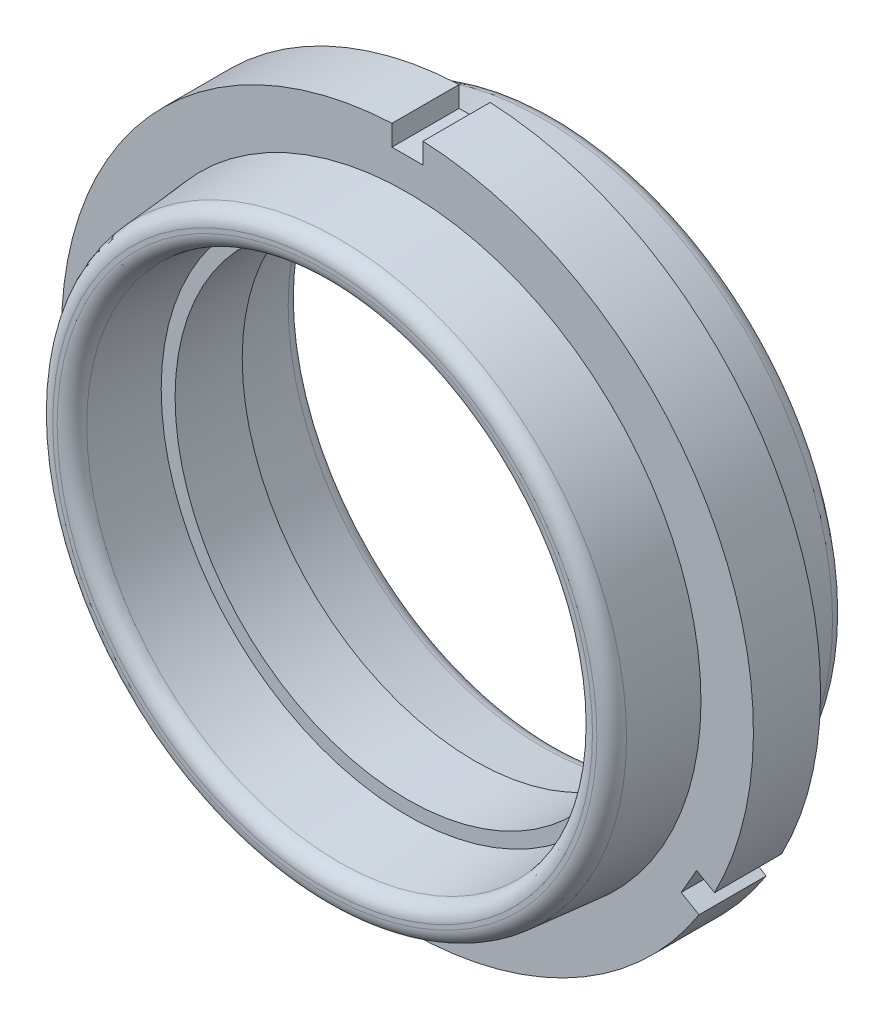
from build123d import *

# Parameters (mm, degrees)
ESQUISSE1_R             = 67
ESQUISSE1_R_2           = 45
EXTRUSION1_DEPTH        = 13
ENL_V_MAT_EXTRU_1_DEPTH = 96.639949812
ESQUISSE3_R             = 56.839275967
ESQUISSE3_R_2           = 47.689606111
EXTRUSION2_DEPTH        = 16
EXTRUSION2_DRAFT        = 5
ESQUISSE4_R             = 57.219872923
ESQUISSE4_R_2           = 48.197619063
EXTRUSION3_DEPTH        = 16
EXTRUSION3_DRAFT        = 5
CONG_1_R                = 3


with BuildPart() as part:
    # Esquisse1 → Extrusion1 (new body)
    with BuildSketch(Plane.XY):
        Circle(ESQUISSE1_R)
        with Locations(Location((0, 0, 0), (0, 0, 180))):
            Circle(ESQUISSE1_R_2, mode=Mode.SUBTRACT)
    extrude(amount=EXTRUSION1_DEPTH)

    # Esquisse2 → Enl_v. mat.-Extru.1 (cut, through all)
    with BuildSketch(Plane.XY.offset(13)):
        with BuildLine():
            Line((3, 66.932802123), (3, 62.932802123))
            Line((3, 62.932802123), (-3, 62.932802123))
            Line((-3, 62.932802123), (-3, 66.932802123))
            ThreePointArc((-3, 66.932802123), (0, 67), (3, 66.932802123))
        make_face()
        with BuildLine():
            Line((56.465506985, -36.064477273), (53.00140537, -34.064477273))
            Line((53.00140537, -34.064477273), (56.00140537, -28.86832485))
            Line((56.00140537, -28.86832485), (59.465506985, -30.86832485))
            ThreePointArc((59.465506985, -30.86832485), (58.023702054, -33.5), (56.465506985, -36.064477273))
        make_face()
        with BuildLine():
            Line((-59.465506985, -30.86832485), (-56.00140537, -28.86832485))
            Line((-56.00140537, -28.86832485), (-53.00140537, -34.064477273))
            Line((-53.00140537, -34.064477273), (-56.465506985, -36.064477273))
            ThreePointArc((-56.465506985, -36.064477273), (-58.023702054, -33.5), (-59.465506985, -30.86832485))
        make_face()
    extrude(amount=-ENL_V_MAT_EXTRU_1_DEPTH, mode=Mode.SUBTRACT)


with BuildPart() as extrusion2_tool:
    # Esquisse3 → Extrusion2 (with draft: the straight prism first)
    with BuildSketch(Plane.XY.offset(13)):
        Circle(ESQUISSE3_R)
        Circle(ESQUISSE3_R_2, mode=Mode.SUBTRACT)
    extrude(amount=EXTRUSION2_DEPTH)
    # Extrusion2: the draft: its side faces are tilted about the plane it starts from
    extrusion2_sides = [extrusion2_tool.faces().sort_by_distance(p)[0] for p in [
        (-56.839275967, 0, 21),
        (-47.689606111, 0, 21),
    ]]
    draft(extrusion2_sides, Plane.XY.offset(13), EXTRUSION2_DRAFT)


with BuildPart() as part_1:
    add(part.part)

    # Extrusion2: add extrusion2_tool
    add(extrusion2_tool.part)


with BuildPart() as extrusion3_tool:
    # Esquisse4 → Extrusion3 (with draft: the straight prism first)
    with BuildSketch(Plane(origin=(0, 0, 0), x_dir=(-1, 0, 0), z_dir=(0, 0, -1))):
        Circle(ESQUISSE4_R)
        Circle(ESQUISSE4_R_2, mode=Mode.SUBTRACT)
    extrude(amount=EXTRUSION3_DEPTH)
    # Extrusion3: the draft: its side faces are tilted about the plane it starts from
    extrusion3_sides = [extrusion3_tool.faces().sort_by_distance(p)[0] for p in [
        (57.219872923, 0, -8),
        (48.197619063, 0, -8),
    ]]
    draft(extrusion3_sides, Plane(origin=(0, 0, 0), x_dir=(-1, 0, 0), z_dir=(0, 0, -1)), EXTRUSION3_DRAFT)


with BuildPart() as part_2:
    add(part_1.part)

    # Extrusion3: add extrusion3_tool
    add(extrusion3_tool.part)

    # Cong_1
    cong_1_edges = [part_2.edges().sort_by_distance(p)[0] for p in [
        (55.820054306, 0, -16),
        (-55.43945735, 0, 29),
        (49.59743768, 0, -16),
        (-49.089424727, 0, 29),
    ]]
    fillet(cong_1_edges, radius=CONG_1_R)


solid = part_2.part
